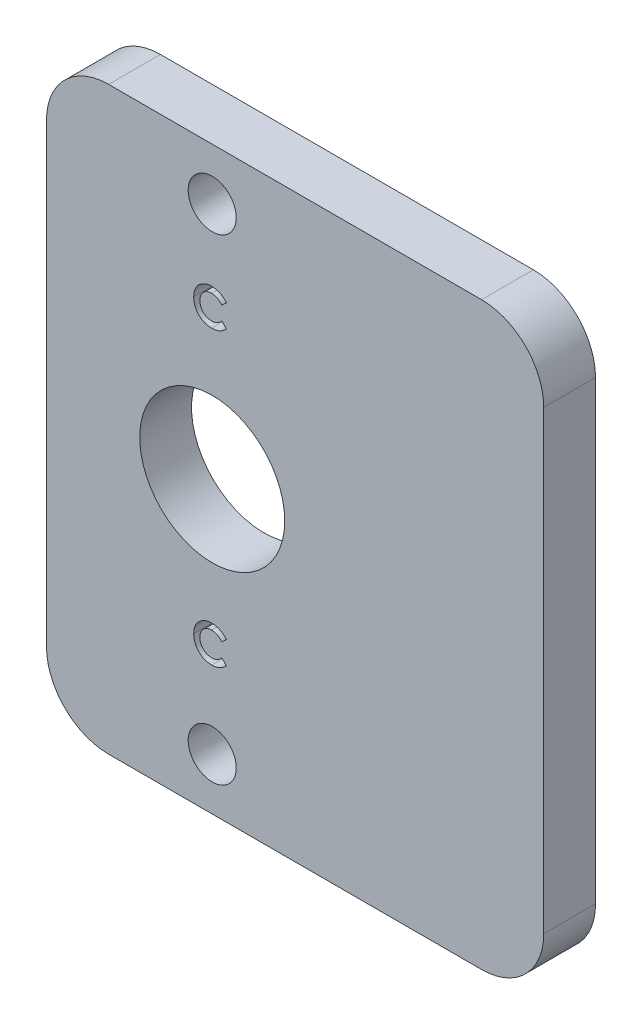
from build123d import *

# Parameters (mm, degrees)
SKETCH2_W                 = 30.48
SKETCH2_H                 = 35.56
SKETCH2_R                 = 4.445
BOSS_EXTRUDE1_DEPTH       = 3.175
F_4_CLEARANCE_HOLE1_D     = 2.9464
F_4_CLEARANCE_HOLE1_DEPTH = 3.302
FILLET1_R                 = 3.81
CUT_EXTRUDE1_DEPTH        = 47.942780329


with BuildPart() as part:
    # Sketch2 → Boss-Extrude1 (new body)
    with BuildSketch(Plane.XY):
        with Locations((15.24, 17.78)):
            Rectangle(SKETCH2_W, SKETCH2_H)
        with Locations((10.16, 17.78)):
            Circle(SKETCH2_R, mode=Mode.SUBTRACT)
    extrude(amount=BOSS_EXTRUDE1_DEPTH)

    # 4 Clearance Hole1
    with Locations(Plane.XY.offset(3.175)):
        with Locations((10.16, 3.175), (10.16, 32.385)):
            Hole(F_4_CLEARANCE_HOLE1_D / 2, depth=F_4_CLEARANCE_HOLE1_DEPTH)

    # Fillet1
    fillet1_edges = [part.edges().sort_by_distance(p)[0] for p in [
        (0, 35.56, 1.5875),
        (30.48, 35.56, 1.5875),
        (30.48, 0, 1.5875),
        (0, 0, 1.5875),
    ]]
    fillet(fillet1_edges, radius=FILLET1_R)

    # Sketch5 → Cut-Extrude1 (cut, through all)
    with BuildSketch(Plane.XY.offset(3.175)):
        with BuildLine():
            Line((11.033803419, 27.581290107), (10.755227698, 27.315010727))
            add(Edge.make_bspline(
                [(10.755227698, 27.315010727), (10.731596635, 27.339445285), (10.685437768, 27.387173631), (10.611058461, 27.450361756), (10.53370669, 27.503020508), (10.454887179, 27.547369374), (10.373182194, 27.580922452), (10.289536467, 27.605373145), (10.203415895, 27.620279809), (10.145132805, 27.621985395), (10.115817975, 27.622843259)],
                knots=[0, 0, 0, 0, 1.115251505, 2.178435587, 3.19620269, 4.182487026, 5.141301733, 6.088180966, 7.038406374, 8, 8, 8, 8], degree=3))
            add(Edge.make_bspline(
                [(10.115817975, 27.622843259), (10.091336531, 27.622165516), (10.043025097, 27.620828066), (9.972091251, 27.611023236), (9.904239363, 27.594349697), (9.839237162, 27.571370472), (9.777275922, 27.541636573), (9.718225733, 27.505171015), (9.662232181, 27.462303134), (9.610034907, 27.41325473), (9.562286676, 27.359665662), (9.520098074, 27.302486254), (9.484758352, 27.241847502), (9.455755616, 27.178363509), (9.433163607, 27.111740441), (9.417030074, 27.042023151), (9.407698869, 26.96912861), (9.406306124, 26.919575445), (9.405598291, 26.894391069)],
                knots=[0, 0, 0, 0, 1.035432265, 2.043311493, 3.022114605, 3.98653278, 4.95457646, 5.923598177, 6.917315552, 7.932509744, 8.948865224, 9.949768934, 10.933144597, 11.912367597, 12.897413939, 13.903909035, 14.934704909, 16, 16, 16, 16], degree=3))
            add(Edge.make_bspline(
                [(9.405598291, 26.894391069), (9.40580228, 26.876714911), (9.406204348, 26.841874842), (9.410605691, 26.790336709), (9.417692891, 26.740332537), (9.427949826, 26.691938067), (9.440776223, 26.645111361), (9.455824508, 26.599448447), (9.47470236, 26.555580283), (9.49565706, 26.512997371), (9.520027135, 26.472861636), (9.546302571, 26.434588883), (9.574793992, 26.398366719), (9.605685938, 26.364343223), (9.639413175, 26.333050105), (9.675103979, 26.303546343), (9.713360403, 26.276570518), (9.753387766, 26.251445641), (9.795531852, 26.229619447), (9.838649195, 26.209849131), (9.883393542, 26.193792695), (9.929220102, 26.180849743), (9.975965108, 26.169843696), (10.024085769, 26.163066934), (10.07316494, 26.157934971), (10.106334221, 26.157618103), (10.123026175, 26.157458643)],
                knots=[0, 0, 0, 0, 1.103660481, 2.175337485, 3.227646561, 4.255952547, 5.262355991, 6.258840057, 7.255597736, 8.242457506, 9.22035537, 10.185017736, 11.140346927, 12.096287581, 13.051739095, 14.01125915, 14.986044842, 15.97314143, 16.960198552, 17.947847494, 18.933482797, 19.925264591, 20.920966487, 21.929612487, 22.958107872, 24, 24, 24, 24], degree=3))
            add(Edge.make_bspline(
                [(10.123026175, 26.157458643), (10.151338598, 26.158277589), (10.206965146, 26.159886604), (10.288605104, 26.172468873), (10.36639985, 26.193165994), (10.42855748, 26.217608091), (10.477256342, 26.241744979), (10.514330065, 26.264070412), (10.552667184, 26.28904386), (10.591630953, 26.317607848), (10.631659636, 26.349419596), (10.672046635, 26.385175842), (10.713825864, 26.423699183), (10.741195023, 26.451194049), (10.755227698, 26.465291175)],
                knots=[0, 0, 0, 0, 1.404581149, 2.759636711, 4.088442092, 5.392261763, 6.066678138, 6.783632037, 7.538459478, 8.336747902, 9.180226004, 10.074962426, 11.012997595, 12, 12, 12, 12], degree=3))
            Line((10.755227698, 26.465291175), (11.025323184, 26.181627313))
            add(Edge.make_bspline(
                [(11.025323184, 26.181627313), (11.006336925, 26.163296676), (10.969279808, 26.127519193), (10.913380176, 26.076718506), (10.857550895, 26.031068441), (10.803140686, 25.988912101), (10.749258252, 25.951477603), (10.695909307, 25.918727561), (10.643697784, 25.889833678), (10.591539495, 25.865283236), (10.539109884, 25.84443736), (10.485165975, 25.82649043), (10.429542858, 25.811307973), (10.37190081, 25.799057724), (10.312777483, 25.789234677), (10.251619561, 25.782604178), (10.188814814, 25.778146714), (10.146213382, 25.777746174), (10.124722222, 25.777544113)],
                knots=[0, 0, 0, 0, 1.244526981, 2.429050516, 3.560637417, 4.644440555, 5.67424972, 6.652764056, 7.595344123, 8.486817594, 9.369275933, 10.254498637, 11.166417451, 12.086725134, 13.032340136, 13.991389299, 14.986715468, 16, 16, 16, 16], degree=3))
            add(Edge.make_bspline(
                [(10.124722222, 25.777544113), (10.085245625, 25.778550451), (10.008000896, 25.780519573), (9.89480076, 25.795109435), (9.78726367, 25.819569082), (9.685128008, 25.854161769), (9.58842625, 25.898352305), (9.497183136, 25.952527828), (9.41154573, 26.016544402), (9.332205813, 26.089651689), (9.260439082, 26.17039255), (9.197005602, 26.257086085), (9.144533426, 26.35015836), (9.100964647, 26.448234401), (9.066894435, 26.551761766), (9.042914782, 26.66085244), (9.028126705, 26.775401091), (9.026508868, 26.853640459), (9.025683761, 26.893543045)],
                knots=[0, 0, 0, 0, 1.078019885, 2.10938526, 3.111377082, 4.085535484, 5.04941344, 6.010039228, 6.978205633, 7.964457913, 8.951525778, 9.924444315, 10.892603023, 11.863865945, 12.85144698, 13.863884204, 14.910567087, 16, 16, 16, 16], degree=3))
            add(Edge.make_bspline(
                [(9.025683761, 26.893543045), (9.026032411, 26.919567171), (9.026723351, 26.971140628), (9.033985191, 27.047112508), (9.044108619, 27.121171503), (9.060168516, 27.192548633), (9.079527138, 27.26220548), (9.103602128, 27.329384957), (9.132355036, 27.394280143), (9.164859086, 27.456999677), (9.201630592, 27.517132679), (9.242708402, 27.574162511), (9.287035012, 27.628529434), (9.335675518, 27.679512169), (9.38792311, 27.727558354), (9.444013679, 27.772407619), (9.50360987, 27.814703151), (9.566872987, 27.853354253), (9.632573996, 27.888316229), (9.699884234, 27.919154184), (9.768638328, 27.944927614), (9.83854558, 27.966305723), (9.909901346, 27.98226297), (9.982196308, 27.994342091), (10.056045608, 28.001094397), (10.105629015, 28.002199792), (10.130658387, 28.002757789)],
                knots=[0, 0, 0, 0, 1.071919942, 2.124283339, 3.142214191, 4.149696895, 5.136002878, 6.119640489, 7.086990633, 8.058538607, 9.028339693, 9.988281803, 10.952401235, 11.916291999, 12.888973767, 13.874849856, 14.873389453, 15.898127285, 16.927174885, 17.938320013, 18.946391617, 19.950418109, 20.947802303, 21.956882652, 22.968648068, 24, 24, 24, 24], degree=3))
            add(Edge.make_bspline(
                [(10.130658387, 28.002757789), (10.152011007, 28.002437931), (10.19449424, 28.001801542), (10.257758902, 27.996496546), (10.320517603, 27.988165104), (10.382545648, 27.975594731), (10.444286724, 27.960672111), (10.504929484, 27.941132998), (10.565430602, 27.919352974), (10.624841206, 27.893319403), (10.683244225, 27.864901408), (10.739271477, 27.832660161), (10.793863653, 27.798579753), (10.845811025, 27.760643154), (10.896086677, 27.720226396), (10.944427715, 27.677140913), (10.990409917, 27.630668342), (11.019265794, 27.597832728), (11.033803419, 27.581290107)],
                knots=[0, 0, 0, 0, 0.996412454, 1.982464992, 2.961075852, 3.949442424, 4.934965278, 5.923860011, 6.921385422, 7.934793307, 8.949617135, 9.951082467, 10.950285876, 11.951772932, 12.951063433, 13.960125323, 14.972308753, 16, 16, 16, 16], degree=3))
        make_face()
        with BuildLine():
            Line((11.033803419, 9.700191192), (10.755227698, 9.433911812))
            add(Edge.make_bspline(
                [(10.755227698, 9.433911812), (10.731596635, 9.45834637), (10.685437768, 9.506074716), (10.611058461, 9.569262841), (10.53370669, 9.621921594), (10.454887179, 9.66627046), (10.373182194, 9.699823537), (10.289536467, 9.72427423), (10.203415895, 9.739180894), (10.145132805, 9.74088648), (10.115817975, 9.741744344)],
                knots=[0, 0, 0, 0, 1.115251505, 2.178435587, 3.19620269, 4.182487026, 5.141301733, 6.088180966, 7.038406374, 8, 8, 8, 8], degree=3))
            add(Edge.make_bspline(
                [(10.115817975, 9.741744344), (10.091336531, 9.741066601), (10.043025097, 9.739729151), (9.972091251, 9.729924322), (9.904239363, 9.713250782), (9.839237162, 9.690271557), (9.777275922, 9.660537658), (9.718225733, 9.624072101), (9.662232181, 9.581204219), (9.610034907, 9.532155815), (9.562286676, 9.478566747), (9.520098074, 9.421387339), (9.484758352, 9.360748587), (9.455755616, 9.297264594), (9.433163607, 9.230641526), (9.417030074, 9.160924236), (9.407698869, 9.088029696), (9.406306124, 9.03847653), (9.405598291, 9.013292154)],
                knots=[0, 0, 0, 0, 1.035432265, 2.043311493, 3.022114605, 3.98653278, 4.95457646, 5.923598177, 6.917315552, 7.932509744, 8.948865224, 9.949768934, 10.933144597, 11.912367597, 12.897413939, 13.903909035, 14.934704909, 16, 16, 16, 16], degree=3))
            add(Edge.make_bspline(
                [(9.405598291, 9.013292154), (9.40580228, 8.995615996), (9.406204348, 8.960775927), (9.410605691, 8.909237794), (9.417692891, 8.859233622), (9.427949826, 8.810839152), (9.440776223, 8.764012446), (9.455824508, 8.718349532), (9.47470236, 8.674481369), (9.49565706, 8.631898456), (9.520027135, 8.591762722), (9.546302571, 8.553489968), (9.574793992, 8.517267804), (9.605685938, 8.483244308), (9.639413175, 8.45195119), (9.675103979, 8.422447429), (9.713360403, 8.395471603), (9.753387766, 8.370346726), (9.795531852, 8.348520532), (9.838649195, 8.328750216), (9.883393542, 8.31269378), (9.929220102, 8.299750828), (9.975965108, 8.288744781), (10.024085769, 8.281968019), (10.07316494, 8.276836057), (10.106334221, 8.276519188), (10.123026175, 8.276359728)],
                knots=[0, 0, 0, 0, 1.103660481, 2.175337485, 3.227646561, 4.255952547, 5.262355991, 6.258840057, 7.255597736, 8.242457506, 9.22035537, 10.185017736, 11.140346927, 12.096287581, 13.051739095, 14.01125915, 14.986044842, 15.97314143, 16.960198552, 17.947847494, 18.933482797, 19.925264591, 20.920966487, 21.929612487, 22.958107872, 24, 24, 24, 24], degree=3))
            add(Edge.make_bspline(
                [(10.123026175, 8.276359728), (10.151338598, 8.277178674), (10.206965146, 8.278787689), (10.288605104, 8.291369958), (10.36639985, 8.312067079), (10.42855748, 8.336509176), (10.477256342, 8.360646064), (10.514330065, 8.382971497), (10.552667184, 8.407944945), (10.591630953, 8.436508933), (10.631659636, 8.468320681), (10.672046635, 8.504076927), (10.713825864, 8.542600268), (10.741195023, 8.570095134), (10.755227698, 8.584192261)],
                knots=[0, 0, 0, 0, 1.404581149, 2.759636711, 4.088442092, 5.392261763, 6.066678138, 6.783632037, 7.538459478, 8.336747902, 9.180226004, 10.074962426, 11.012997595, 12, 12, 12, 12], degree=3))
            Line((10.755227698, 8.584192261), (11.025323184, 8.300528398))
            add(Edge.make_bspline(
                [(11.025323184, 8.300528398), (11.006336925, 8.282197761), (10.969279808, 8.246420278), (10.913380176, 8.195619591), (10.857550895, 8.149969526), (10.803140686, 8.107813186), (10.749258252, 8.070378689), (10.695909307, 8.037628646), (10.643697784, 8.008734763), (10.591539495, 7.984184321), (10.539109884, 7.963338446), (10.485165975, 7.945391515), (10.429542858, 7.930209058), (10.37190081, 7.917958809), (10.312777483, 7.908135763), (10.251619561, 7.901505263), (10.188814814, 7.897047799), (10.146213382, 7.896647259), (10.124722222, 7.896445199)],
                knots=[0, 0, 0, 0, 1.244526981, 2.429050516, 3.560637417, 4.644440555, 5.67424972, 6.652764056, 7.595344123, 8.486817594, 9.369275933, 10.254498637, 11.166417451, 12.086725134, 13.032340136, 13.991389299, 14.986715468, 16, 16, 16, 16], degree=3))
            add(Edge.make_bspline(
                [(10.124722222, 7.896445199), (10.085245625, 7.897451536), (10.008000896, 7.899420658), (9.89480076, 7.91401052), (9.78726367, 7.938470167), (9.685128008, 7.973062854), (9.58842625, 8.017253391), (9.497183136, 8.071428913), (9.41154573, 8.135445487), (9.332205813, 8.208552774), (9.260439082, 8.289293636), (9.197005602, 8.37598717), (9.144533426, 8.469059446), (9.100964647, 8.567135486), (9.066894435, 8.670662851), (9.042914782, 8.779753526), (9.028126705, 8.894302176), (9.026508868, 8.972541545), (9.025683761, 9.01244413)],
                knots=[0, 0, 0, 0, 1.078019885, 2.10938526, 3.111377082, 4.085535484, 5.04941344, 6.010039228, 6.978205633, 7.964457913, 8.951525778, 9.924444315, 10.892603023, 11.863865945, 12.85144698, 13.863884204, 14.910567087, 16, 16, 16, 16], degree=3))
            add(Edge.make_bspline(
                [(9.025683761, 9.01244413), (9.026032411, 9.038468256), (9.026723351, 9.090041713), (9.033985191, 9.166013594), (9.044108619, 9.240072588), (9.060168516, 9.311449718), (9.079527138, 9.381106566), (9.103602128, 9.448286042), (9.132355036, 9.513181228), (9.164859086, 9.575900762), (9.201630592, 9.636033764), (9.242708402, 9.693063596), (9.287035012, 9.747430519), (9.335675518, 9.798413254), (9.38792311, 9.84645944), (9.444013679, 9.891308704), (9.50360987, 9.933604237), (9.566872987, 9.972255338), (9.632573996, 10.007217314), (9.699884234, 10.03805527), (9.768638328, 10.063828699), (9.83854558, 10.085206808), (9.909901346, 10.101164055), (9.982196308, 10.113243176), (10.056045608, 10.119995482), (10.105629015, 10.121100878), (10.130658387, 10.121658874)],
                knots=[0, 0, 0, 0, 1.071919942, 2.124283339, 3.142214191, 4.149696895, 5.136002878, 6.119640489, 7.086990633, 8.058538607, 9.028339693, 9.988281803, 10.952401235, 11.916291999, 12.888973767, 13.874849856, 14.873389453, 15.898127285, 16.927174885, 17.938320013, 18.946391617, 19.950418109, 20.947802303, 21.956882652, 22.968648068, 24, 24, 24, 24], degree=3))
            add(Edge.make_bspline(
                [(10.130658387, 10.121658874), (10.152011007, 10.121339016), (10.19449424, 10.120702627), (10.257758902, 10.115397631), (10.320517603, 10.107066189), (10.382545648, 10.094495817), (10.444286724, 10.079573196), (10.504929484, 10.060034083), (10.565430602, 10.038254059), (10.624841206, 10.012220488), (10.683244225, 9.983802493), (10.739271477, 9.951561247), (10.793863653, 9.917480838), (10.845811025, 9.879544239), (10.896086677, 9.839127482), (10.944427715, 9.796041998), (10.990409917, 9.749569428), (11.019265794, 9.716733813), (11.033803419, 9.700191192)],
                knots=[0, 0, 0, 0, 0.996412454, 1.982464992, 2.961075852, 3.949442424, 4.934965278, 5.923860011, 6.921385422, 7.934793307, 8.949617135, 9.951082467, 10.950285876, 11.951772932, 12.951063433, 13.960125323, 14.972308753, 16, 16, 16, 16], degree=3))
        make_face()
    extrude(amount=-CUT_EXTRUDE1_DEPTH, mode=Mode.SUBTRACT)


solid = part.part
